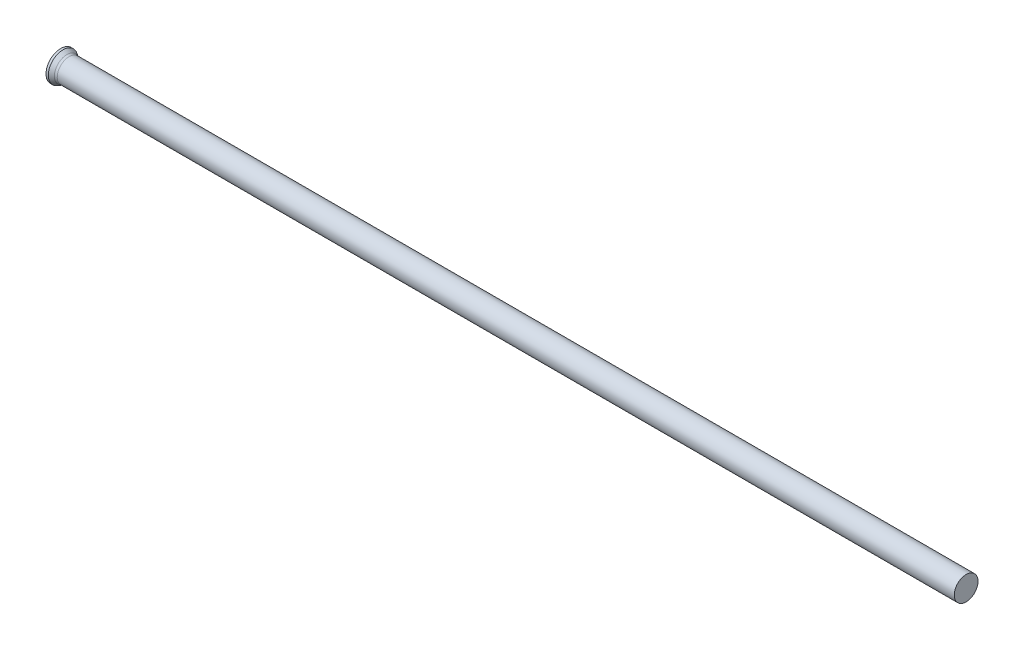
ISO-10303-21;
HEADER;
FILE_DESCRIPTION(('STEP AP214'),'2;1');
FILE_NAME('part.step','',(''),(''),'','','');
FILE_SCHEMA(('AUTOMOTIVE_DESIGN { 1 0 10303 214 1 1 1 1 }'));
ENDSEC;
DATA;
#1=APPLICATION_CONTEXT('core data for automotive mechanical design processes');
#2=APPLICATION_PROTOCOL_DEFINITION('international standard','automotive_design',2000,#1);
#3=PRODUCT_CONTEXT('',#1,'mechanical');
#4=PRODUCT('Part','Part','',(#3));
#5=PRODUCT_RELATED_PRODUCT_CATEGORY('part','',(#4));
#6=PRODUCT_DEFINITION_FORMATION('','',#4);
#7=PRODUCT_DEFINITION_CONTEXT('part definition',#1,'design');
#8=PRODUCT_DEFINITION('design','',#6,#7);
#9=PRODUCT_DEFINITION_SHAPE('','',#8);
#10=(LENGTH_UNIT() NAMED_UNIT(*) SI_UNIT(.MILLI.,.METRE.));
#11=(NAMED_UNIT(*) PLANE_ANGLE_UNIT() SI_UNIT($,.RADIAN.));
#12=(NAMED_UNIT(*) SI_UNIT($,.STERADIAN.) SOLID_ANGLE_UNIT());
#13=UNCERTAINTY_MEASURE_WITH_UNIT(LENGTH_MEASURE(1.E-05),#10,'distance_accuracy_value','');
#14=(GEOMETRIC_REPRESENTATION_CONTEXT(3) GLOBAL_UNCERTAINTY_ASSIGNED_CONTEXT((#13)) GLOBAL_UNIT_ASSIGNED_CONTEXT((#10,
#11,#12)) REPRESENTATION_CONTEXT('',''));
#15=CARTESIAN_POINT('',(0.,0.,0.));
#16=DIRECTION('',(0.,0.,1.));
#17=DIRECTION('',(1.,0.,0.));
#18=AXIS2_PLACEMENT_3D('',#15,#16,#17);
#19=CARTESIAN_POINT('',(0.,0.,0.));
#20=DIRECTION('',(1.,0.,0.));
#21=DIRECTION('',(0.,0.,-1.));
#22=AXIS2_PLACEMENT_3D('',#19,#20,#21);
#23=PLANE('',#22);
#24=CARTESIAN_POINT('',(0.,0.,0.));
#25=DIRECTION('',(-1.,0.,0.));
#26=DIRECTION('',(0.,0.,1.));
#27=AXIS2_PLACEMENT_3D('',#24,#25,#26);
#28=CIRCLE('',#27,3.25);
#29=CARTESIAN_POINT('',(0.,0.,3.25));
#30=VERTEX_POINT('',#29);
#31=EDGE_CURVE('E25',#30,#30,#28,.T.);
#32=ORIENTED_EDGE('',*,*,#31,.T.);
#33=EDGE_LOOP('',(#32));
#34=FACE_BOUND('',#33,.T.);
#35=ADVANCED_FACE('F14',(#34),#23,.F.);
#36=CARTESIAN_POINT('',(0.,0.,0.));
#37=DIRECTION('',(-1.,0.,0.));
#38=DIRECTION('',(0.,0.,1.));
#39=AXIS2_PLACEMENT_3D('',#36,#37,#38);
#40=CYLINDRICAL_SURFACE('',#39,3.25);
#41=ORIENTED_EDGE('',*,*,#31,.F.);
#42=EDGE_LOOP('',(#41));
#43=FACE_BOUND('',#42,.T.);
#44=CARTESIAN_POINT('',(0.507468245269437,0.,0.));
#45=DIRECTION('',(-1.,0.,0.));
#46=DIRECTION('',(0.,0.,1.));
#47=AXIS2_PLACEMENT_3D('',#44,#45,#46);
#48=CIRCLE('',#47,3.25);
#49=CARTESIAN_POINT('',(0.507468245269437,0.,3.25));
#50=VERTEX_POINT('',#49);
#51=EDGE_CURVE('E29',#50,#50,#48,.T.);
#52=ORIENTED_EDGE('',*,*,#51,.T.);
#53=EDGE_LOOP('',(#52));
#54=FACE_BOUND('',#53,.T.);
#55=ADVANCED_FACE('F53',(#43,#54),#40,.T.);
#56=CARTESIAN_POINT('',(1.59,0.,0.));
#57=DIRECTION('',(-1.,0.,0.));
#58=DIRECTION('',(0.,0.,1.));
#59=AXIS2_PLACEMENT_3D('',#56,#57,#58);
#60=CONICAL_SURFACE('',#59,2.625,0.523598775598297);
#61=CARTESIAN_POINT('',(1.35794919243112,0.,0.));
#62=DIRECTION('',(-1.,0.,0.));
#63=DIRECTION('',(0.,0.,1.));
#64=AXIS2_PLACEMENT_3D('',#61,#62,#63);
#65=CIRCLE('',#64,2.75897459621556);
#66=CARTESIAN_POINT('',(1.35794919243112,0.,2.75897459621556));
#67=VERTEX_POINT('',#66);
#68=EDGE_CURVE('E21',#67,#67,#65,.T.);
#69=ORIENTED_EDGE('',*,*,#68,.T.);
#70=EDGE_LOOP('',(#69));
#71=FACE_BOUND('',#70,.T.);
#72=ORIENTED_EDGE('',*,*,#51,.F.);
#73=EDGE_LOOP('',(#72));
#74=FACE_BOUND('',#73,.T.);
#75=ADVANCED_FACE('F50',(#71,#74),#60,.T.);
#76=CARTESIAN_POINT('',(0.,0.,0.));
#77=DIRECTION('',(-1.,0.,0.));
#78=DIRECTION('',(0.,0.,1.));
#79=AXIS2_PLACEMENT_3D('',#76,#77,#78);
#80=CYLINDRICAL_SURFACE('',#79,2.625);
#81=CARTESIAN_POINT('',(1.85794919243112,0.,0.));
#82=DIRECTION('',(-1.,0.,0.));
#83=DIRECTION('',(0.,0.,1.));
#84=AXIS2_PLACEMENT_3D('',#81,#82,#83);
#85=CIRCLE('',#84,2.625);
#86=CARTESIAN_POINT('',(1.85794919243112,0.,2.625));
#87=VERTEX_POINT('',#86);
#88=EDGE_CURVE('E9',#87,#87,#85,.F.);
#89=ORIENTED_EDGE('',*,*,#88,.T.);
#90=EDGE_LOOP('',(#89));
#91=FACE_BOUND('',#90,.T.);
#92=CARTESIAN_POINT('',(200.,0.,0.));
#93=DIRECTION('',(-1.,0.,0.));
#94=DIRECTION('',(0.,0.,1.));
#95=AXIS2_PLACEMENT_3D('',#92,#93,#94);
#96=CIRCLE('',#95,2.625);
#97=CARTESIAN_POINT('',(200.,0.,2.625));
#98=VERTEX_POINT('',#97);
#99=EDGE_CURVE('E34',#98,#98,#96,.T.);
#100=ORIENTED_EDGE('',*,*,#99,.T.);
#101=EDGE_LOOP('',(#100));
#102=FACE_BOUND('',#101,.T.);
#103=ADVANCED_FACE('F38',(#91,#102),#80,.T.);
#104=CARTESIAN_POINT('',(200.,2.625,0.));
#105=DIRECTION('',(-1.,0.,0.));
#106=DIRECTION('',(0.,0.,1.));
#107=AXIS2_PLACEMENT_3D('',#104,#105,#106);
#108=PLANE('',#107);
#109=ORIENTED_EDGE('',*,*,#99,.F.);
#110=EDGE_LOOP('',(#109));
#111=FACE_BOUND('',#110,.T.);
#112=ADVANCED_FACE('F40',(#111),#108,.F.);
#113=CARTESIAN_POINT('',(1.85794919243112,0.,0.));
#114=DIRECTION('',(-1.,0.,0.));
#115=DIRECTION('',(0.,0.,1.));
#116=AXIS2_PLACEMENT_3D('',#113,#114,#115);
#117=TOROIDAL_SURFACE('',#116,3.625,1.);
#118=ORIENTED_EDGE('',*,*,#88,.F.);
#119=EDGE_LOOP('',(#118));
#120=FACE_BOUND('',#119,.T.);
#121=ORIENTED_EDGE('',*,*,#68,.F.);
#122=EDGE_LOOP('',(#121));
#123=FACE_BOUND('',#122,.T.);
#124=ADVANCED_FACE('F16',(#120,#123),#117,.F.);
#125=CLOSED_SHELL('',(#35,#55,#75,#103,#112,#124));
#126=MANIFOLD_SOLID_BREP('B1',#125);
#127=ADVANCED_BREP_SHAPE_REPRESENTATION('',(#18,#126),#14);
#128=SHAPE_DEFINITION_REPRESENTATION(#9,#127);
ENDSEC;
END-ISO-10303-21;
